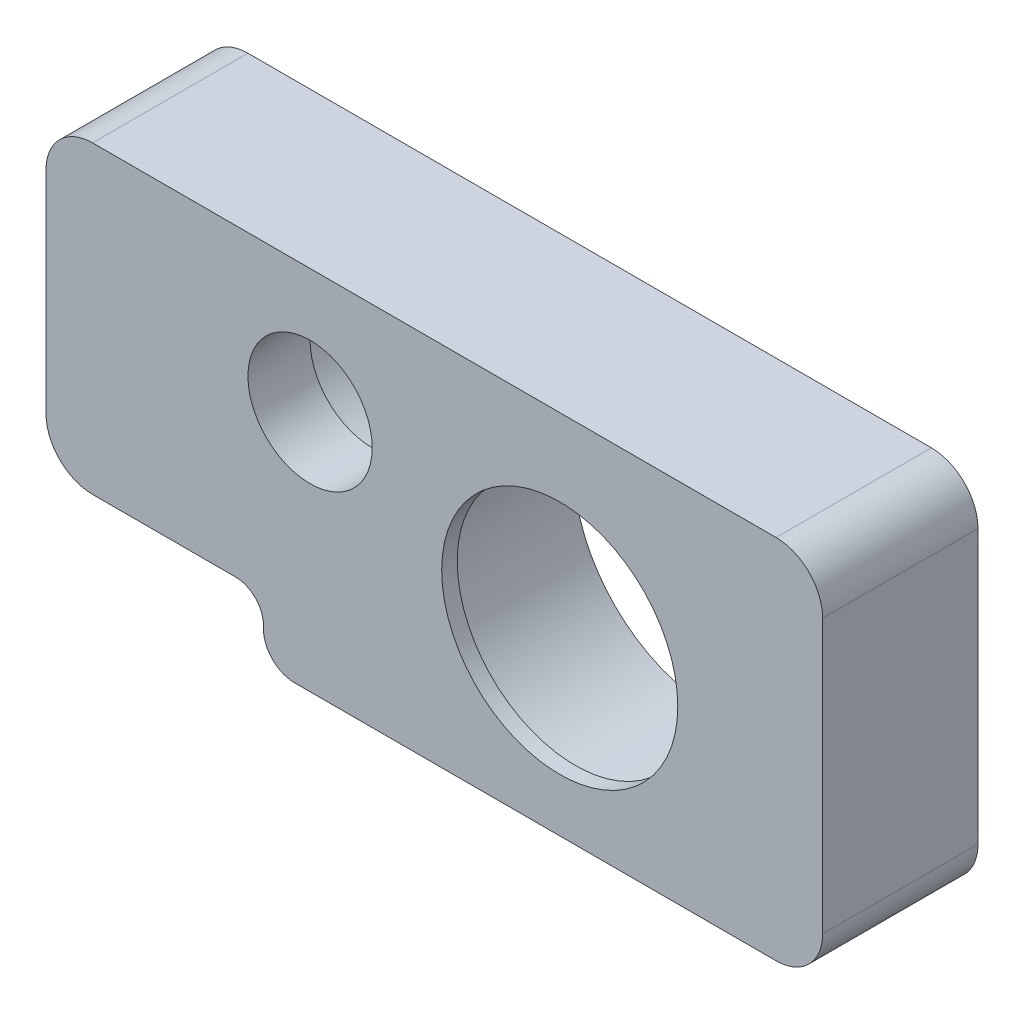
ISO-10303-21;
HEADER;
FILE_DESCRIPTION(('STEP AP214'),'2;1');
FILE_NAME('part.step','',(''),(''),'','','');
FILE_SCHEMA(('AUTOMOTIVE_DESIGN { 1 0 10303 214 1 1 1 1 }'));
ENDSEC;
DATA;
#1=APPLICATION_CONTEXT('core data for automotive mechanical design processes');
#2=APPLICATION_PROTOCOL_DEFINITION('international standard','automotive_design',2000,#1);
#3=PRODUCT_CONTEXT('',#1,'mechanical');
#4=PRODUCT('Part','Part','',(#3));
#5=PRODUCT_RELATED_PRODUCT_CATEGORY('part','',(#4));
#6=PRODUCT_DEFINITION_FORMATION('','',#4);
#7=PRODUCT_DEFINITION_CONTEXT('part definition',#1,'design');
#8=PRODUCT_DEFINITION('design','',#6,#7);
#9=PRODUCT_DEFINITION_SHAPE('','',#8);
#10=(LENGTH_UNIT() NAMED_UNIT(*) SI_UNIT(.MILLI.,.METRE.));
#11=(NAMED_UNIT(*) PLANE_ANGLE_UNIT() SI_UNIT($,.RADIAN.));
#12=(NAMED_UNIT(*) SI_UNIT($,.STERADIAN.) SOLID_ANGLE_UNIT());
#13=UNCERTAINTY_MEASURE_WITH_UNIT(LENGTH_MEASURE(1.E-05),#10,'distance_accuracy_value','');
#14=(GEOMETRIC_REPRESENTATION_CONTEXT(3) GLOBAL_UNCERTAINTY_ASSIGNED_CONTEXT((#13)) GLOBAL_UNIT_ASSIGNED_CONTEXT((#10,
#11,#12)) REPRESENTATION_CONTEXT('',''));
#15=CARTESIAN_POINT('',(0.,0.,0.));
#16=DIRECTION('',(0.,0.,1.));
#17=DIRECTION('',(1.,0.,0.));
#18=AXIS2_PLACEMENT_3D('',#15,#16,#17);
#19=CARTESIAN_POINT('',(-4.00000000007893,1.90000000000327,0.));
#20=DIRECTION('',(0.,0.,1.));
#21=DIRECTION('',(1.,0.,0.));
#22=AXIS2_PLACEMENT_3D('',#19,#20,#21);
#23=CYLINDRICAL_SURFACE('',#22,2.0000000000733);
#24=CARTESIAN_POINT('',(-4.00000000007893,1.90000000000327,5.));
#25=DIRECTION('',(0.,0.,1.));
#26=DIRECTION('',(1.,0.,0.));
#27=AXIS2_PLACEMENT_3D('',#24,#25,#26);
#28=CIRCLE('',#27,2.0000000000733);
#29=CARTESIAN_POINT('',(-2.00000000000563,1.90000000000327,5.));
#30=VERTEX_POINT('',#29);
#31=EDGE_CURVE('E205',#30,#30,#28,.T.);
#32=ORIENTED_EDGE('',*,*,#31,.T.);
#33=EDGE_LOOP('',(#32));
#34=FACE_BOUND('',#33,.T.);
#35=CARTESIAN_POINT('',(-4.00000000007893,1.90000000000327,3.));
#36=DIRECTION('',(0.,0.,-1.));
#37=DIRECTION('',(-1.,0.,0.));
#38=AXIS2_PLACEMENT_3D('',#35,#36,#37);
#39=CIRCLE('',#38,2.0000000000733);
#40=CARTESIAN_POINT('',(-6.00000000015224,1.90000000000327,3.));
#41=VERTEX_POINT('',#40);
#42=EDGE_CURVE('E203',#41,#41,#39,.F.);
#43=ORIENTED_EDGE('',*,*,#42,.F.);
#44=EDGE_LOOP('',(#43));
#45=FACE_BOUND('',#44,.T.);
#46=ADVANCED_FACE('F34',(#34,#45),#23,.F.);
#47=CARTESIAN_POINT('',(-6.4,-4.8,5.));
#48=DIRECTION('',(0.,0.,-1.));
#49=DIRECTION('',(-1.,0.,0.));
#50=AXIS2_PLACEMENT_3D('',#47,#48,#49);
#51=CYLINDRICAL_SURFACE('',#50,0.9);
#52=CARTESIAN_POINT('',(-6.4,-4.8,0.));
#53=DIRECTION('',(0.,0.,-1.));
#54=DIRECTION('',(1.,0.,0.));
#55=AXIS2_PLACEMENT_3D('',#52,#53,#54);
#56=CIRCLE('',#55,0.9);
#57=CARTESIAN_POINT('',(-6.4,-3.9,0.));
#58=VERTEX_POINT('',#57);
#59=CARTESIAN_POINT('',(-5.5,-4.8,0.));
#60=VERTEX_POINT('',#59);
#61=EDGE_CURVE('E157',#58,#60,#56,.T.);
#62=ORIENTED_EDGE('',*,*,#61,.T.);
#63=DIRECTION('',(0.,0.,-1.));
#64=VECTOR('',#63,1.);
#65=CARTESIAN_POINT('',(-5.5,-4.8,5.));
#66=LINE('',#65,#64);
#67=CARTESIAN_POINT('',(-5.5,-4.8,5.));
#68=VERTEX_POINT('',#67);
#69=EDGE_CURVE('E12',#68,#60,#66,.T.);
#70=ORIENTED_EDGE('',*,*,#69,.F.);
#71=CARTESIAN_POINT('',(-6.4,-4.8,5.));
#72=DIRECTION('',(0.,0.,-1.));
#73=DIRECTION('',(1.,0.,0.));
#74=AXIS2_PLACEMENT_3D('',#71,#72,#73);
#75=CIRCLE('',#74,0.9);
#76=CARTESIAN_POINT('',(-6.4,-3.9,5.));
#77=VERTEX_POINT('',#76);
#78=EDGE_CURVE('E180',#77,#68,#75,.T.);
#79=ORIENTED_EDGE('',*,*,#78,.F.);
#80=DIRECTION('',(0.,0.,-1.));
#81=VECTOR('',#80,1.);
#82=CARTESIAN_POINT('',(-6.4,-3.9,5.));
#83=LINE('',#82,#81);
#84=EDGE_CURVE('E153',#77,#58,#83,.T.);
#85=ORIENTED_EDGE('',*,*,#84,.T.);
#86=EDGE_LOOP('',(#62,#70,#79,#85));
#87=FACE_BOUND('',#86,.T.);
#88=ADVANCED_FACE('F36',(#87),#51,.F.);
#89=CARTESIAN_POINT('',(-5.5,-4.8,5.));
#90=DIRECTION('',(1.,0.,0.));
#91=DIRECTION('',(0.,0.,-1.));
#92=AXIS2_PLACEMENT_3D('',#89,#90,#91);
#93=PLANE('',#92);
#94=DIRECTION('',(0.,-1.,0.));
#95=VECTOR('',#94,1.);
#96=CARTESIAN_POINT('',(-5.5,-4.8,0.));
#97=LINE('',#96,#95);
#98=CARTESIAN_POINT('',(-5.5,-4.9,0.));
#99=VERTEX_POINT('',#98);
#100=EDGE_CURVE('E160',#60,#99,#97,.T.);
#101=ORIENTED_EDGE('',*,*,#100,.T.);
#102=DIRECTION('',(0.,0.,-1.));
#103=VECTOR('',#102,1.);
#104=CARTESIAN_POINT('',(-5.5,-4.9,5.));
#105=LINE('',#104,#103);
#106=CARTESIAN_POINT('',(-5.5,-4.9,5.));
#107=VERTEX_POINT('',#106);
#108=EDGE_CURVE('E44',#107,#99,#105,.T.);
#109=ORIENTED_EDGE('',*,*,#108,.F.);
#110=DIRECTION('',(0.,-1.,0.));
#111=VECTOR('',#110,1.);
#112=CARTESIAN_POINT('',(-5.5,-4.8,5.));
#113=LINE('',#112,#111);
#114=EDGE_CURVE('E108',#68,#107,#113,.T.);
#115=ORIENTED_EDGE('',*,*,#114,.F.);
#116=ORIENTED_EDGE('',*,*,#69,.T.);
#117=EDGE_LOOP('',(#101,#109,#115,#116));
#118=FACE_BOUND('',#117,.T.);
#119=ADVANCED_FACE('F271',(#118),#93,.F.);
#120=CARTESIAN_POINT('',(-4.5,-4.9,5.));
#121=DIRECTION('',(0.,0.,-1.));
#122=DIRECTION('',(-1.,0.,0.));
#123=AXIS2_PLACEMENT_3D('',#120,#121,#122);
#124=CYLINDRICAL_SURFACE('',#123,1.);
#125=CARTESIAN_POINT('',(-4.5,-4.9,0.));
#126=DIRECTION('',(0.,0.,1.));
#127=DIRECTION('',(-1.,0.,0.));
#128=AXIS2_PLACEMENT_3D('',#125,#126,#127);
#129=CIRCLE('',#128,1.);
#130=CARTESIAN_POINT('',(-4.49999999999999,-5.9,0.));
#131=VERTEX_POINT('',#130);
#132=EDGE_CURVE('E163',#99,#131,#129,.T.);
#133=ORIENTED_EDGE('',*,*,#132,.T.);
#134=DIRECTION('',(0.,0.,-1.));
#135=VECTOR('',#134,1.);
#136=CARTESIAN_POINT('',(-4.49999999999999,-5.9,5.));
#137=LINE('',#136,#135);
#138=CARTESIAN_POINT('',(-4.49999999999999,-5.9,5.));
#139=VERTEX_POINT('',#138);
#140=EDGE_CURVE('E199',#139,#131,#137,.T.);
#141=ORIENTED_EDGE('',*,*,#140,.F.);
#142=CARTESIAN_POINT('',(-4.5,-4.9,5.));
#143=DIRECTION('',(0.,0.,1.));
#144=DIRECTION('',(-1.,0.,0.));
#145=AXIS2_PLACEMENT_3D('',#142,#143,#144);
#146=CIRCLE('',#145,1.);
#147=EDGE_CURVE('E226',#107,#139,#146,.T.);
#148=ORIENTED_EDGE('',*,*,#147,.F.);
#149=ORIENTED_EDGE('',*,*,#108,.T.);
#150=EDGE_LOOP('',(#133,#141,#148,#149));
#151=FACE_BOUND('',#150,.T.);
#152=ADVANCED_FACE('F424',(#151),#124,.T.);
#153=CARTESIAN_POINT('',(-4.49999999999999,-5.9,5.));
#154=DIRECTION('',(0.,1.,0.));
#155=DIRECTION('',(0.,0.,1.));
#156=AXIS2_PLACEMENT_3D('',#153,#154,#155);
#157=PLANE('',#156);
#158=DIRECTION('',(1.,0.,0.));
#159=VECTOR('',#158,1.);
#160=CARTESIAN_POINT('',(-4.49999999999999,-5.9,0.));
#161=LINE('',#160,#159);
#162=CARTESIAN_POINT('',(11.,-5.9,0.));
#163=VERTEX_POINT('',#162);
#164=EDGE_CURVE('E165',#131,#163,#161,.T.);
#165=ORIENTED_EDGE('',*,*,#164,.T.);
#166=DIRECTION('',(0.,0.,-1.));
#167=VECTOR('',#166,1.);
#168=CARTESIAN_POINT('',(11.,-5.9,5.));
#169=LINE('',#168,#167);
#170=CARTESIAN_POINT('',(11.,-5.9,5.));
#171=VERTEX_POINT('',#170);
#172=EDGE_CURVE('E196',#171,#163,#169,.T.);
#173=ORIENTED_EDGE('',*,*,#172,.F.);
#174=DIRECTION('',(1.,0.,0.));
#175=VECTOR('',#174,1.);
#176=CARTESIAN_POINT('',(-4.49999999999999,-5.9,5.));
#177=LINE('',#176,#175);
#178=EDGE_CURVE('E228',#139,#171,#177,.T.);
#179=ORIENTED_EDGE('',*,*,#178,.F.);
#180=ORIENTED_EDGE('',*,*,#140,.T.);
#181=EDGE_LOOP('',(#165,#173,#179,#180));
#182=FACE_BOUND('',#181,.T.);
#183=ADVANCED_FACE('F414',(#182),#157,.F.);
#184=CARTESIAN_POINT('',(11.,-4.4,5.));
#185=DIRECTION('',(0.,0.,-1.));
#186=DIRECTION('',(-1.,0.,0.));
#187=AXIS2_PLACEMENT_3D('',#184,#185,#186);
#188=CYLINDRICAL_SURFACE('',#187,1.5);
#189=CARTESIAN_POINT('',(11.,-4.4,0.));
#190=DIRECTION('',(0.,0.,1.));
#191=DIRECTION('',(-1.,0.,0.));
#192=AXIS2_PLACEMENT_3D('',#189,#190,#191);
#193=CIRCLE('',#192,1.5);
#194=CARTESIAN_POINT('',(12.5,-4.4,0.));
#195=VERTEX_POINT('',#194);
#196=EDGE_CURVE('E167',#163,#195,#193,.T.);
#197=ORIENTED_EDGE('',*,*,#196,.T.);
#198=DIRECTION('',(0.,0.,-1.));
#199=VECTOR('',#198,1.);
#200=CARTESIAN_POINT('',(12.5,-4.4,5.));
#201=LINE('',#200,#199);
#202=CARTESIAN_POINT('',(12.5,-4.4,5.));
#203=VERTEX_POINT('',#202);
#204=EDGE_CURVE('E193',#203,#195,#201,.T.);
#205=ORIENTED_EDGE('',*,*,#204,.F.);
#206=CARTESIAN_POINT('',(11.,-4.4,5.));
#207=DIRECTION('',(0.,0.,1.));
#208=DIRECTION('',(-1.,0.,0.));
#209=AXIS2_PLACEMENT_3D('',#206,#207,#208);
#210=CIRCLE('',#209,1.5);
#211=EDGE_CURVE('E230',#171,#203,#210,.T.);
#212=ORIENTED_EDGE('',*,*,#211,.F.);
#213=ORIENTED_EDGE('',*,*,#172,.T.);
#214=EDGE_LOOP('',(#197,#205,#212,#213));
#215=FACE_BOUND('',#214,.T.);
#216=ADVANCED_FACE('F404',(#215),#188,.T.);
#217=CARTESIAN_POINT('',(12.5,-4.4,5.));
#218=DIRECTION('',(-1.,0.,0.));
#219=DIRECTION('',(0.,0.,1.));
#220=AXIS2_PLACEMENT_3D('',#217,#218,#219);
#221=PLANE('',#220);
#222=DIRECTION('',(0.,1.,0.));
#223=VECTOR('',#222,1.);
#224=CARTESIAN_POINT('',(12.5,-4.4,0.));
#225=LINE('',#224,#223);
#226=CARTESIAN_POINT('',(12.5,4.4,0.));
#227=VERTEX_POINT('',#226);
#228=EDGE_CURVE('E169',#195,#227,#225,.T.);
#229=ORIENTED_EDGE('',*,*,#228,.T.);
#230=DIRECTION('',(0.,0.,-1.));
#231=VECTOR('',#230,1.);
#232=CARTESIAN_POINT('',(12.5,4.4,5.));
#233=LINE('',#232,#231);
#234=CARTESIAN_POINT('',(12.5,4.4,5.));
#235=VERTEX_POINT('',#234);
#236=EDGE_CURVE('E190',#235,#227,#233,.T.);
#237=ORIENTED_EDGE('',*,*,#236,.F.);
#238=DIRECTION('',(0.,1.,0.));
#239=VECTOR('',#238,1.);
#240=CARTESIAN_POINT('',(12.5,-4.4,5.));
#241=LINE('',#240,#239);
#242=EDGE_CURVE('E232',#203,#235,#241,.T.);
#243=ORIENTED_EDGE('',*,*,#242,.F.);
#244=ORIENTED_EDGE('',*,*,#204,.T.);
#245=EDGE_LOOP('',(#229,#237,#243,#244));
#246=FACE_BOUND('',#245,.T.);
#247=ADVANCED_FACE('F394',(#246),#221,.F.);
#248=CARTESIAN_POINT('',(11.,4.4,5.));
#249=DIRECTION('',(0.,0.,-1.));
#250=DIRECTION('',(-1.,0.,0.));
#251=AXIS2_PLACEMENT_3D('',#248,#249,#250);
#252=CYLINDRICAL_SURFACE('',#251,1.5);
#253=CARTESIAN_POINT('',(11.,4.4,0.));
#254=DIRECTION('',(0.,0.,1.));
#255=DIRECTION('',(-1.,0.,0.));
#256=AXIS2_PLACEMENT_3D('',#253,#254,#255);
#257=CIRCLE('',#256,1.5);
#258=CARTESIAN_POINT('',(11.,5.9,0.));
#259=VERTEX_POINT('',#258);
#260=EDGE_CURVE('E171',#227,#259,#257,.T.);
#261=ORIENTED_EDGE('',*,*,#260,.T.);
#262=DIRECTION('',(0.,0.,-1.));
#263=VECTOR('',#262,1.);
#264=CARTESIAN_POINT('',(11.,5.9,5.));
#265=LINE('',#264,#263);
#266=CARTESIAN_POINT('',(11.,5.9,5.));
#267=VERTEX_POINT('',#266);
#268=EDGE_CURVE('E187',#267,#259,#265,.T.);
#269=ORIENTED_EDGE('',*,*,#268,.F.);
#270=CARTESIAN_POINT('',(11.,4.4,5.));
#271=DIRECTION('',(0.,0.,1.));
#272=DIRECTION('',(-1.,0.,0.));
#273=AXIS2_PLACEMENT_3D('',#270,#271,#272);
#274=CIRCLE('',#273,1.5);
#275=EDGE_CURVE('E234',#235,#267,#274,.T.);
#276=ORIENTED_EDGE('',*,*,#275,.F.);
#277=ORIENTED_EDGE('',*,*,#236,.T.);
#278=EDGE_LOOP('',(#261,#269,#276,#277));
#279=FACE_BOUND('',#278,.T.);
#280=ADVANCED_FACE('F385',(#279),#252,.T.);
#281=CARTESIAN_POINT('',(-11.,5.9,5.));
#282=DIRECTION('',(0.,-1.,0.));
#283=DIRECTION('',(0.,0.,-1.));
#284=AXIS2_PLACEMENT_3D('',#281,#282,#283);
#285=PLANE('',#284);
#286=DIRECTION('',(-1.,0.,0.));
#287=VECTOR('',#286,1.);
#288=CARTESIAN_POINT('',(-11.,5.9,0.));
#289=LINE('',#288,#287);
#290=CARTESIAN_POINT('',(-11.,5.9,0.));
#291=VERTEX_POINT('',#290);
#292=EDGE_CURVE('E173',#259,#291,#289,.T.);
#293=ORIENTED_EDGE('',*,*,#292,.T.);
#294=DIRECTION('',(0.,0.,-1.));
#295=VECTOR('',#294,1.);
#296=CARTESIAN_POINT('',(-11.,5.9,5.));
#297=LINE('',#296,#295);
#298=CARTESIAN_POINT('',(-11.,5.9,5.));
#299=VERTEX_POINT('',#298);
#300=EDGE_CURVE('E184',#299,#291,#297,.T.);
#301=ORIENTED_EDGE('',*,*,#300,.F.);
#302=DIRECTION('',(-1.,0.,0.));
#303=VECTOR('',#302,1.);
#304=CARTESIAN_POINT('',(-11.,5.9,5.));
#305=LINE('',#304,#303);
#306=EDGE_CURVE('E236',#267,#299,#305,.T.);
#307=ORIENTED_EDGE('',*,*,#306,.F.);
#308=ORIENTED_EDGE('',*,*,#268,.T.);
#309=EDGE_LOOP('',(#293,#301,#307,#308));
#310=FACE_BOUND('',#309,.T.);
#311=ADVANCED_FACE('F242',(#310),#285,.F.);
#312=CARTESIAN_POINT('',(-11.,4.4,5.));
#313=DIRECTION('',(0.,0.,-1.));
#314=DIRECTION('',(-1.,0.,0.));
#315=AXIS2_PLACEMENT_3D('',#312,#313,#314);
#316=CYLINDRICAL_SURFACE('',#315,1.5);
#317=CARTESIAN_POINT('',(-11.,4.4,0.));
#318=DIRECTION('',(0.,0.,1.));
#319=DIRECTION('',(-1.,0.,0.));
#320=AXIS2_PLACEMENT_3D('',#317,#318,#319);
#321=CIRCLE('',#320,1.5);
#322=CARTESIAN_POINT('',(-12.5,4.4,0.));
#323=VERTEX_POINT('',#322);
#324=EDGE_CURVE('E175',#291,#323,#321,.T.);
#325=ORIENTED_EDGE('',*,*,#324,.T.);
#326=DIRECTION('',(0.,0.,-1.));
#327=VECTOR('',#326,1.);
#328=CARTESIAN_POINT('',(-12.5,4.4,5.));
#329=LINE('',#328,#327);
#330=CARTESIAN_POINT('',(-12.5,4.4,5.));
#331=VERTEX_POINT('',#330);
#332=EDGE_CURVE('E148',#331,#323,#329,.T.);
#333=ORIENTED_EDGE('',*,*,#332,.F.);
#334=CARTESIAN_POINT('',(-11.,4.4,5.));
#335=DIRECTION('',(0.,0.,1.));
#336=DIRECTION('',(-1.,0.,0.));
#337=AXIS2_PLACEMENT_3D('',#334,#335,#336);
#338=CIRCLE('',#337,1.5);
#339=EDGE_CURVE('E139',#299,#331,#338,.T.);
#340=ORIENTED_EDGE('',*,*,#339,.F.);
#341=ORIENTED_EDGE('',*,*,#300,.T.);
#342=EDGE_LOOP('',(#325,#333,#340,#341));
#343=FACE_BOUND('',#342,.T.);
#344=ADVANCED_FACE('F246',(#343),#316,.T.);
#345=CARTESIAN_POINT('',(-12.5,-2.4,5.));
#346=DIRECTION('',(1.,0.,0.));
#347=DIRECTION('',(0.,0.,-1.));
#348=AXIS2_PLACEMENT_3D('',#345,#346,#347);
#349=PLANE('',#348);
#350=DIRECTION('',(0.,-1.,0.));
#351=VECTOR('',#350,1.);
#352=CARTESIAN_POINT('',(-12.5,-2.4,0.));
#353=LINE('',#352,#351);
#354=CARTESIAN_POINT('',(-12.5,-2.4,0.));
#355=VERTEX_POINT('',#354);
#356=EDGE_CURVE('E147',#323,#355,#353,.T.);
#357=ORIENTED_EDGE('',*,*,#356,.T.);
#358=DIRECTION('',(0.,0.,-1.));
#359=VECTOR('',#358,1.);
#360=CARTESIAN_POINT('',(-12.5,-2.4,5.));
#361=LINE('',#360,#359);
#362=CARTESIAN_POINT('',(-12.5,-2.4,5.));
#363=VERTEX_POINT('',#362);
#364=EDGE_CURVE('E144',#363,#355,#361,.T.);
#365=ORIENTED_EDGE('',*,*,#364,.F.);
#366=DIRECTION('',(0.,-1.,0.));
#367=VECTOR('',#366,1.);
#368=CARTESIAN_POINT('',(-12.5,-2.4,5.));
#369=LINE('',#368,#367);
#370=EDGE_CURVE('E133',#331,#363,#369,.T.);
#371=ORIENTED_EDGE('',*,*,#370,.F.);
#372=ORIENTED_EDGE('',*,*,#332,.T.);
#373=EDGE_LOOP('',(#357,#365,#371,#372));
#374=FACE_BOUND('',#373,.T.);
#375=ADVANCED_FACE('F145',(#374),#349,.F.);
#376=CARTESIAN_POINT('',(-11.,-2.4,5.));
#377=DIRECTION('',(0.,0.,-1.));
#378=DIRECTION('',(-1.,0.,0.));
#379=AXIS2_PLACEMENT_3D('',#376,#377,#378);
#380=CYLINDRICAL_SURFACE('',#379,1.5);
#381=CARTESIAN_POINT('',(-11.,-2.4,0.));
#382=DIRECTION('',(0.,0.,1.));
#383=DIRECTION('',(1.,0.,0.));
#384=AXIS2_PLACEMENT_3D('',#381,#382,#383);
#385=CIRCLE('',#384,1.5);
#386=CARTESIAN_POINT('',(-11.,-3.9,0.));
#387=VERTEX_POINT('',#386);
#388=EDGE_CURVE('E94',#355,#387,#385,.T.);
#389=ORIENTED_EDGE('',*,*,#388,.T.);
#390=DIRECTION('',(0.,0.,-1.));
#391=VECTOR('',#390,1.);
#392=CARTESIAN_POINT('',(-11.,-3.9,5.));
#393=LINE('',#392,#391);
#394=CARTESIAN_POINT('',(-11.,-3.9,5.));
#395=VERTEX_POINT('',#394);
#396=EDGE_CURVE('E149',#395,#387,#393,.T.);
#397=ORIENTED_EDGE('',*,*,#396,.F.);
#398=CARTESIAN_POINT('',(-11.,-2.4,5.));
#399=DIRECTION('',(0.,0.,1.));
#400=DIRECTION('',(1.,0.,0.));
#401=AXIS2_PLACEMENT_3D('',#398,#399,#400);
#402=CIRCLE('',#401,1.5);
#403=EDGE_CURVE('E137',#363,#395,#402,.T.);
#404=ORIENTED_EDGE('',*,*,#403,.F.);
#405=ORIENTED_EDGE('',*,*,#364,.T.);
#406=EDGE_LOOP('',(#389,#397,#404,#405));
#407=FACE_BOUND('',#406,.T.);
#408=ADVANCED_FACE('F151',(#407),#380,.T.);
#409=CARTESIAN_POINT('',(-11.,-3.9,5.));
#410=DIRECTION('',(0.,1.,0.));
#411=DIRECTION('',(0.,0.,1.));
#412=AXIS2_PLACEMENT_3D('',#409,#410,#411);
#413=PLANE('',#412);
#414=DIRECTION('',(1.,0.,0.));
#415=VECTOR('',#414,1.);
#416=CARTESIAN_POINT('',(-11.,-3.9,0.));
#417=LINE('',#416,#415);
#418=EDGE_CURVE('E100',#387,#58,#417,.T.);
#419=ORIENTED_EDGE('',*,*,#418,.T.);
#420=ORIENTED_EDGE('',*,*,#84,.F.);
#421=DIRECTION('',(1.,0.,0.));
#422=VECTOR('',#421,1.);
#423=CARTESIAN_POINT('',(-11.,-3.9,5.));
#424=LINE('',#423,#422);
#425=EDGE_CURVE('E53',#395,#77,#424,.T.);
#426=ORIENTED_EDGE('',*,*,#425,.F.);
#427=ORIENTED_EDGE('',*,*,#396,.T.);
#428=EDGE_LOOP('',(#419,#420,#426,#427));
#429=FACE_BOUND('',#428,.T.);
#430=ADVANCED_FACE('F254',(#429),#413,.F.);
#431=CARTESIAN_POINT('',(-6.4,-4.8,5.));
#432=DIRECTION('',(0.,0.,1.));
#433=DIRECTION('',(1.,0.,0.));
#434=AXIS2_PLACEMENT_3D('',#431,#432,#433);
#435=PLANE('',#434);
#436=CARTESIAN_POINT('',(4.03666998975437,-0.38718483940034,5.));
#437=DIRECTION('',(0.,0.,1.));
#438=DIRECTION('',(1.,0.,0.));
#439=AXIS2_PLACEMENT_3D('',#436,#437,#438);
#440=CIRCLE('',#439,3.80000000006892);
#441=CARTESIAN_POINT('',(7.83666998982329,-0.38718483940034,5.));
#442=VERTEX_POINT('',#441);
#443=EDGE_CURVE('E161',#442,#442,#440,.T.);
#444=ORIENTED_EDGE('',*,*,#443,.F.);
#445=EDGE_LOOP('',(#444));
#446=FACE_BOUND('',#445,.T.);
#447=ORIENTED_EDGE('',*,*,#31,.F.);
#448=EDGE_LOOP('',(#447));
#449=FACE_BOUND('',#448,.T.);
#450=ORIENTED_EDGE('',*,*,#78,.T.);
#451=ORIENTED_EDGE('',*,*,#114,.T.);
#452=ORIENTED_EDGE('',*,*,#147,.T.);
#453=ORIENTED_EDGE('',*,*,#178,.T.);
#454=ORIENTED_EDGE('',*,*,#211,.T.);
#455=ORIENTED_EDGE('',*,*,#242,.T.);
#456=ORIENTED_EDGE('',*,*,#275,.T.);
#457=ORIENTED_EDGE('',*,*,#306,.T.);
#458=ORIENTED_EDGE('',*,*,#339,.T.);
#459=ORIENTED_EDGE('',*,*,#370,.T.);
#460=ORIENTED_EDGE('',*,*,#403,.T.);
#461=ORIENTED_EDGE('',*,*,#425,.T.);
#462=EDGE_LOOP('',(#450,#451,#452,#453,#454,#455,#456,#457,#458,#459,#460,#461));
#463=FACE_BOUND('',#462,.T.);
#464=ADVANCED_FACE('F135',(#446,#449,#463),#435,.T.);
#465=CARTESIAN_POINT('',(-6.4,-4.8,0.));
#466=DIRECTION('',(0.,0.,1.));
#467=DIRECTION('',(1.,0.,0.));
#468=AXIS2_PLACEMENT_3D('',#465,#466,#467);
#469=PLANE('',#468);
#470=CARTESIAN_POINT('',(4.03666998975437,-0.38718483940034,0.));
#471=DIRECTION('',(0.,0.,-1.));
#472=DIRECTION('',(-1.,0.,0.));
#473=AXIS2_PLACEMENT_3D('',#470,#471,#472);
#474=CIRCLE('',#473,4.54999999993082);
#475=CARTESIAN_POINT('',(-0.513330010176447,-0.38718483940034,0.));
#476=VERTEX_POINT('',#475);
#477=EDGE_CURVE('E286',#476,#476,#474,.T.);
#478=ORIENTED_EDGE('',*,*,#477,.F.);
#479=EDGE_LOOP('',(#478));
#480=FACE_BOUND('',#479,.T.);
#481=CARTESIAN_POINT('',(-4.00000000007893,1.90000000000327,0.));
#482=DIRECTION('',(0.,0.,-1.));
#483=DIRECTION('',(-1.,0.,0.));
#484=AXIS2_PLACEMENT_3D('',#481,#482,#483);
#485=CIRCLE('',#484,3.09999999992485);
#486=CARTESIAN_POINT('',(-7.10000000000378,1.90000000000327,0.));
#487=VERTEX_POINT('',#486);
#488=EDGE_CURVE('E212',#487,#487,#485,.T.);
#489=ORIENTED_EDGE('',*,*,#488,.F.);
#490=EDGE_LOOP('',(#489));
#491=FACE_BOUND('',#490,.T.);
#492=ORIENTED_EDGE('',*,*,#61,.F.);
#493=ORIENTED_EDGE('',*,*,#418,.F.);
#494=ORIENTED_EDGE('',*,*,#388,.F.);
#495=ORIENTED_EDGE('',*,*,#356,.F.);
#496=ORIENTED_EDGE('',*,*,#324,.F.);
#497=ORIENTED_EDGE('',*,*,#292,.F.);
#498=ORIENTED_EDGE('',*,*,#260,.F.);
#499=ORIENTED_EDGE('',*,*,#228,.F.);
#500=ORIENTED_EDGE('',*,*,#196,.F.);
#501=ORIENTED_EDGE('',*,*,#164,.F.);
#502=ORIENTED_EDGE('',*,*,#132,.F.);
#503=ORIENTED_EDGE('',*,*,#100,.F.);
#504=EDGE_LOOP('',(#492,#493,#494,#495,#496,#497,#498,#499,#500,#501,#502,#503));
#505=FACE_BOUND('',#504,.T.);
#506=ADVANCED_FACE('F249',(#480,#491,#505),#469,.F.);
#507=CARTESIAN_POINT('',(4.03666998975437,-0.38718483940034,0.));
#508=DIRECTION('',(0.,0.,1.));
#509=DIRECTION('',(1.,0.,0.));
#510=AXIS2_PLACEMENT_3D('',#507,#508,#509);
#511=CYLINDRICAL_SURFACE('',#510,3.80000000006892);
#512=CARTESIAN_POINT('',(4.03666998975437,-0.38718483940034,4.5));
#513=DIRECTION('',(0.,0.,1.));
#514=DIRECTION('',(1.,0.,0.));
#515=AXIS2_PLACEMENT_3D('',#512,#513,#514);
#516=CIRCLE('',#515,3.80000000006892);
#517=CARTESIAN_POINT('',(7.83666998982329,-0.38718483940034,4.5));
#518=VERTEX_POINT('',#517);
#519=EDGE_CURVE('E38',#518,#518,#516,.F.);
#520=ORIENTED_EDGE('',*,*,#519,.T.);
#521=EDGE_LOOP('',(#520));
#522=FACE_BOUND('',#521,.T.);
#523=ORIENTED_EDGE('',*,*,#443,.T.);
#524=EDGE_LOOP('',(#523));
#525=FACE_BOUND('',#524,.T.);
#526=ADVANCED_FACE('F274',(#522,#525),#511,.F.);
#527=CARTESIAN_POINT('',(-4.00000000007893,1.90000000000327,3.));
#528=DIRECTION('',(0.,0.,-1.));
#529=DIRECTION('',(-1.,0.,0.));
#530=AXIS2_PLACEMENT_3D('',#527,#528,#529);
#531=PLANE('',#530);
#532=CARTESIAN_POINT('',(-4.00000000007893,1.90000000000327,3.));
#533=DIRECTION('',(0.,0.,-1.));
#534=DIRECTION('',(-1.,0.,0.));
#535=AXIS2_PLACEMENT_3D('',#532,#533,#534);
#536=CIRCLE('',#535,3.09999999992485);
#537=CARTESIAN_POINT('',(-7.10000000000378,1.90000000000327,3.));
#538=VERTEX_POINT('',#537);
#539=EDGE_CURVE('E206',#538,#538,#536,.T.);
#540=ORIENTED_EDGE('',*,*,#539,.T.);
#541=EDGE_LOOP('',(#540));
#542=FACE_BOUND('',#541,.T.);
#543=ORIENTED_EDGE('',*,*,#42,.T.);
#544=EDGE_LOOP('',(#543));
#545=FACE_BOUND('',#544,.T.);
#546=ADVANCED_FACE('F281',(#542,#545),#531,.T.);
#547=CARTESIAN_POINT('',(-4.00000000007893,1.90000000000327,3.));
#548=DIRECTION('',(0.,0.,-1.));
#549=DIRECTION('',(-1.,0.,0.));
#550=AXIS2_PLACEMENT_3D('',#547,#548,#549);
#551=CYLINDRICAL_SURFACE('',#550,3.09999999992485);
#552=ORIENTED_EDGE('',*,*,#539,.F.);
#553=EDGE_LOOP('',(#552));
#554=FACE_BOUND('',#553,.T.);
#555=ORIENTED_EDGE('',*,*,#488,.T.);
#556=EDGE_LOOP('',(#555));
#557=FACE_BOUND('',#556,.T.);
#558=ADVANCED_FACE('F289',(#554,#557),#551,.F.);
#559=CARTESIAN_POINT('',(-6.4,-4.8,4.5));
#560=DIRECTION('',(0.,0.,1.));
#561=DIRECTION('',(1.,0.,0.));
#562=AXIS2_PLACEMENT_3D('',#559,#560,#561);
#563=PLANE('',#562);
#564=CARTESIAN_POINT('',(4.03666998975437,-0.38718483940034,4.5));
#565=DIRECTION('',(0.,0.,1.));
#566=DIRECTION('',(1.,0.,0.));
#567=AXIS2_PLACEMENT_3D('',#564,#565,#566);
#568=CIRCLE('',#567,4.54999999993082);
#569=CARTESIAN_POINT('',(8.58666998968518,-0.38718483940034,4.5));
#570=VERTEX_POINT('',#569);
#571=EDGE_CURVE('E219',#570,#570,#568,.F.);
#572=ORIENTED_EDGE('',*,*,#571,.T.);
#573=EDGE_LOOP('',(#572));
#574=FACE_BOUND('',#573,.T.);
#575=ORIENTED_EDGE('',*,*,#519,.F.);
#576=EDGE_LOOP('',(#575));
#577=FACE_BOUND('',#576,.T.);
#578=ADVANCED_FACE('F291',(#574,#577),#563,.F.);
#579=CARTESIAN_POINT('',(4.03666998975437,-0.38718483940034,17.8693434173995));
#580=DIRECTION('',(0.,0.,-1.));
#581=DIRECTION('',(-1.,0.,0.));
#582=AXIS2_PLACEMENT_3D('',#579,#580,#581);
#583=CYLINDRICAL_SURFACE('',#582,4.54999999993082);
#584=ORIENTED_EDGE('',*,*,#477,.T.);
#585=EDGE_LOOP('',(#584));
#586=FACE_BOUND('',#585,.T.);
#587=ORIENTED_EDGE('',*,*,#571,.F.);
#588=EDGE_LOOP('',(#587));
#589=FACE_BOUND('',#588,.T.);
#590=ADVANCED_FACE('F297',(#586,#589),#583,.F.);
#591=CLOSED_SHELL('',(#46,#88,#119,#152,#183,#216,#247,#280,#311,#344,#375,#408,#430,#464,#506,
#526,#546,#558,#578,#590));
#592=MANIFOLD_SOLID_BREP('B2',#591);
#593=ADVANCED_BREP_SHAPE_REPRESENTATION('',(#18,#592),#14);
#594=SHAPE_DEFINITION_REPRESENTATION(#9,#593);
ENDSEC;
END-ISO-10303-21;
